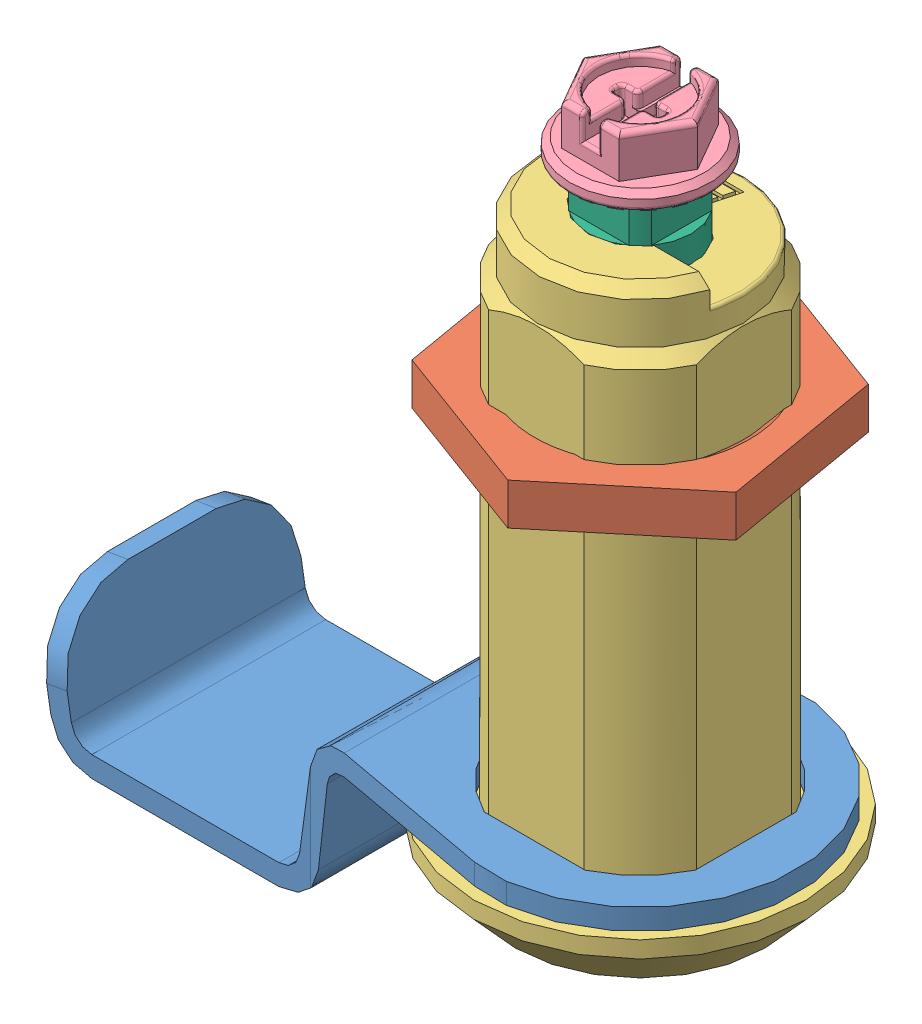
SolidWorks assembly 21.1087_8 BOLT LOCK 32 SOCKET HEX HEAD 10.sldasm, configuration Default (file format 3800). Lengths in mm.
Overall size (67.62 72.67 40.69).
8 component instances, 6 part files, 0 mates.
Components (placement in the parent):
- 1000-359 FINGER PULL-1: 1000-359 FINGER PULL.sldprt [Default] x (-1 0 0) z (0 -1 0) size (62 29.92 15)
- 1000-U229 HOUSING 50mm Zn BLACK-1: 1000-U229 HOUSING 50mm Zn BLACK.sldasm [Default] at (0 -2 0) x (-1 0 0) z (0 -1 0) size (41.23 40.69 56)
  - 1000-02-1: 1000-02.sldprt [Default] at (0 0 -32) x (0.769007 -0.639241 0) z (0.639241 0.769007 0) size (31.18 4.57 27)
  - 1000-118-1: 1000-118.sldprt [Default] x (-1 0 0) z (0 1 0) size (32 56 32)
- 1000-U96 10mm HEX CHROME INSERT-1: 1000-U96 10mm HEX CHROME INSERT.sldasm [Default] at (0 40.4 0) x (1 0 0) z (0 -1 0) size (16 16 31.27)
  - 1000-277-01_PRT-1: 1000-277-01_PRT.sldprt [Default] at (0 0 -11.75) x (0 0 -1) z (0 1 0) size (15.52 13.5 13.5)
  - 1000-03_PRT-1: 1000-03_PRT.sldprt [Default] x (1 0 0) z (0 1 0) size (15.2 2.68 15.2)
  - 1000-175-1: 1000-175.sldprt [Default] x (1 0 0) z (0 -1 0) size (16 25.3 16)
